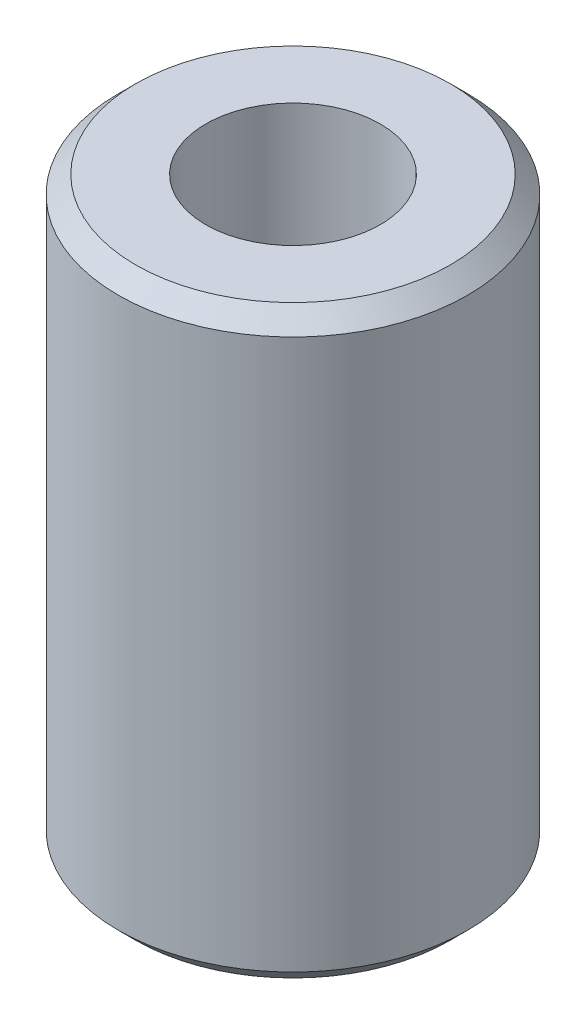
ISO-10303-21;
HEADER;
FILE_DESCRIPTION(('STEP AP214'),'2;1');
FILE_NAME('part.step','',(''),(''),'','','');
FILE_SCHEMA(('AUTOMOTIVE_DESIGN { 1 0 10303 214 1 1 1 1 }'));
ENDSEC;
DATA;
#1=APPLICATION_CONTEXT('core data for automotive mechanical design processes');
#2=APPLICATION_PROTOCOL_DEFINITION('international standard','automotive_design',2000,#1);
#3=PRODUCT_CONTEXT('',#1,'mechanical');
#4=PRODUCT('Part','Part','',(#3));
#5=PRODUCT_RELATED_PRODUCT_CATEGORY('part','',(#4));
#6=PRODUCT_DEFINITION_FORMATION('','',#4);
#7=PRODUCT_DEFINITION_CONTEXT('part definition',#1,'design');
#8=PRODUCT_DEFINITION('design','',#6,#7);
#9=PRODUCT_DEFINITION_SHAPE('','',#8);
#10=(LENGTH_UNIT() NAMED_UNIT(*) SI_UNIT(.MILLI.,.METRE.));
#11=(NAMED_UNIT(*) PLANE_ANGLE_UNIT() SI_UNIT($,.RADIAN.));
#12=(NAMED_UNIT(*) SI_UNIT($,.STERADIAN.) SOLID_ANGLE_UNIT());
#13=UNCERTAINTY_MEASURE_WITH_UNIT(LENGTH_MEASURE(1.E-05),#10,'distance_accuracy_value','');
#14=(GEOMETRIC_REPRESENTATION_CONTEXT(3) GLOBAL_UNCERTAINTY_ASSIGNED_CONTEXT((#13)) GLOBAL_UNIT_ASSIGNED_CONTEXT((#10,
#11,#12)) REPRESENTATION_CONTEXT('',''));
#15=CARTESIAN_POINT('',(0.,0.,0.));
#16=DIRECTION('',(0.,0.,1.));
#17=DIRECTION('',(1.,0.,0.));
#18=AXIS2_PLACEMENT_3D('',#15,#16,#17);
#19=CARTESIAN_POINT('',(0.,16.75,0.));
#20=DIRECTION('',(0.,1.,0.));
#21=DIRECTION('',(0.,0.,1.));
#22=AXIS2_PLACEMENT_3D('',#19,#20,#21);
#23=PLANE('',#22);
#24=CARTESIAN_POINT('',(0.,16.75,0.));
#25=DIRECTION('',(0.,1.,0.));
#26=DIRECTION('',(0.,0.,1.));
#27=AXIS2_PLACEMENT_3D('',#24,#25,#26);
#28=CIRCLE('',#27,4.49999999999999);
#29=CARTESIAN_POINT('',(0.,16.75,4.49999999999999));
#30=VERTEX_POINT('',#29);
#31=EDGE_CURVE('E10',#30,#30,#28,.T.);
#32=ORIENTED_EDGE('',*,*,#31,.T.);
#33=EDGE_LOOP('',(#32));
#34=FACE_BOUND('',#33,.T.);
#35=CARTESIAN_POINT('',(0.,16.75,0.));
#36=DIRECTION('',(0.,1.,0.));
#37=DIRECTION('',(0.,0.,1.));
#38=AXIS2_PLACEMENT_3D('',#35,#36,#37);
#39=CIRCLE('',#38,2.5);
#40=CARTESIAN_POINT('',(0.,16.75,2.5));
#41=VERTEX_POINT('',#40);
#42=EDGE_CURVE('E56',#41,#41,#39,.T.);
#43=ORIENTED_EDGE('',*,*,#42,.F.);
#44=EDGE_LOOP('',(#43));
#45=FACE_BOUND('',#44,.T.);
#46=ADVANCED_FACE('F30',(#34,#45),#23,.T.);
#47=CARTESIAN_POINT('',(0.,0.,0.));
#48=DIRECTION('',(0.,1.,0.));
#49=DIRECTION('',(0.,0.,1.));
#50=AXIS2_PLACEMENT_3D('',#47,#48,#49);
#51=PLANE('',#50);
#52=CARTESIAN_POINT('',(0.,0.,0.));
#53=DIRECTION('',(0.,1.,0.));
#54=DIRECTION('',(0.,0.,1.));
#55=AXIS2_PLACEMENT_3D('',#52,#53,#54);
#56=CIRCLE('',#55,3.00000000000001);
#57=CARTESIAN_POINT('',(0.,0.,3.00000000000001));
#58=VERTEX_POINT('',#57);
#59=EDGE_CURVE('E50',#58,#58,#56,.T.);
#60=ORIENTED_EDGE('',*,*,#59,.T.);
#61=EDGE_LOOP('',(#60));
#62=FACE_BOUND('',#61,.T.);
#63=CARTESIAN_POINT('',(0.,0.,0.));
#64=DIRECTION('',(0.,1.,0.));
#65=DIRECTION('',(0.,0.,1.));
#66=AXIS2_PLACEMENT_3D('',#63,#64,#65);
#67=CIRCLE('',#66,4.5);
#68=CARTESIAN_POINT('',(0.,0.,4.5));
#69=VERTEX_POINT('',#68);
#70=EDGE_CURVE('E53',#69,#69,#67,.F.);
#71=ORIENTED_EDGE('',*,*,#70,.T.);
#72=EDGE_LOOP('',(#71));
#73=FACE_BOUND('',#72,.T.);
#74=ADVANCED_FACE('F63',(#62,#73),#51,.F.);
#75=CARTESIAN_POINT('',(0.,16.75,0.));
#76=DIRECTION('',(0.,-1.,0.));
#77=DIRECTION('',(0.,0.,-1.));
#78=AXIS2_PLACEMENT_3D('',#75,#76,#77);
#79=CYLINDRICAL_SURFACE('',#78,5.);
#80=CARTESIAN_POINT('',(0.,0.5,0.));
#81=DIRECTION('',(0.,1.,0.));
#82=DIRECTION('',(0.,0.,1.));
#83=AXIS2_PLACEMENT_3D('',#80,#81,#82);
#84=CIRCLE('',#83,5.);
#85=CARTESIAN_POINT('',(0.,0.5,5.));
#86=VERTEX_POINT('',#85);
#87=EDGE_CURVE('E37',#86,#86,#84,.T.);
#88=ORIENTED_EDGE('',*,*,#87,.T.);
#89=EDGE_LOOP('',(#88));
#90=FACE_BOUND('',#89,.T.);
#91=CARTESIAN_POINT('',(0.,16.25,0.));
#92=DIRECTION('',(0.,1.,0.));
#93=DIRECTION('',(0.,0.,1.));
#94=AXIS2_PLACEMENT_3D('',#91,#92,#93);
#95=CIRCLE('',#94,5.);
#96=CARTESIAN_POINT('',(0.,16.25,5.));
#97=VERTEX_POINT('',#96);
#98=EDGE_CURVE('E41',#97,#97,#95,.F.);
#99=ORIENTED_EDGE('',*,*,#98,.T.);
#100=EDGE_LOOP('',(#99));
#101=FACE_BOUND('',#100,.T.);
#102=ADVANCED_FACE('F68',(#90,#101),#79,.T.);
#103=CARTESIAN_POINT('',(0.,16.75,0.));
#104=DIRECTION('',(0.,-1.,0.));
#105=DIRECTION('',(0.,0.,-1.));
#106=AXIS2_PLACEMENT_3D('',#103,#104,#105);
#107=CYLINDRICAL_SURFACE('',#106,2.5);
#108=CARTESIAN_POINT('',(0.,0.500000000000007,0.));
#109=DIRECTION('',(0.,1.,0.));
#110=DIRECTION('',(0.,0.,1.));
#111=AXIS2_PLACEMENT_3D('',#108,#109,#110);
#112=CIRCLE('',#111,2.5);
#113=CARTESIAN_POINT('',(0.,0.500000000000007,2.5));
#114=VERTEX_POINT('',#113);
#115=EDGE_CURVE('E45',#114,#114,#112,.F.);
#116=ORIENTED_EDGE('',*,*,#115,.T.);
#117=EDGE_LOOP('',(#116));
#118=FACE_BOUND('',#117,.T.);
#119=ORIENTED_EDGE('',*,*,#42,.T.);
#120=EDGE_LOOP('',(#119));
#121=FACE_BOUND('',#120,.T.);
#122=ADVANCED_FACE('F60',(#118,#121),#107,.F.);
#123=CARTESIAN_POINT('',(0.,0.,0.));
#124=DIRECTION('',(0.,-1.,0.));
#125=DIRECTION('',(0.,0.,-1.));
#126=AXIS2_PLACEMENT_3D('',#123,#124,#125);
#127=CONICAL_SURFACE('',#126,3.00000000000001,0.785398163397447);
#128=ORIENTED_EDGE('',*,*,#115,.F.);
#129=EDGE_LOOP('',(#128));
#130=FACE_BOUND('',#129,.T.);
#131=ORIENTED_EDGE('',*,*,#59,.F.);
#132=EDGE_LOOP('',(#131));
#133=FACE_BOUND('',#132,.T.);
#134=ADVANCED_FACE('F75',(#130,#133),#127,.F.);
#135=CARTESIAN_POINT('',(0.,0.5,0.));
#136=DIRECTION('',(0.,1.,0.));
#137=DIRECTION('',(0.,0.,1.));
#138=AXIS2_PLACEMENT_3D('',#135,#136,#137);
#139=CONICAL_SURFACE('',#138,5.,0.785398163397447);
#140=ORIENTED_EDGE('',*,*,#70,.F.);
#141=EDGE_LOOP('',(#140));
#142=FACE_BOUND('',#141,.T.);
#143=ORIENTED_EDGE('',*,*,#87,.F.);
#144=EDGE_LOOP('',(#143));
#145=FACE_BOUND('',#144,.T.);
#146=ADVANCED_FACE('F77',(#142,#145),#139,.T.);
#147=CARTESIAN_POINT('',(0.,16.75,0.));
#148=DIRECTION('',(0.,-1.,0.));
#149=DIRECTION('',(0.,0.,-1.));
#150=AXIS2_PLACEMENT_3D('',#147,#148,#149);
#151=CONICAL_SURFACE('',#150,4.49999999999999,0.785398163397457);
#152=ORIENTED_EDGE('',*,*,#98,.F.);
#153=EDGE_LOOP('',(#152));
#154=FACE_BOUND('',#153,.T.);
#155=ORIENTED_EDGE('',*,*,#31,.F.);
#156=EDGE_LOOP('',(#155));
#157=FACE_BOUND('',#156,.T.);
#158=ADVANCED_FACE('F32',(#154,#157),#151,.T.);
#159=CLOSED_SHELL('',(#46,#74,#102,#122,#134,#146,#158));
#160=MANIFOLD_SOLID_BREP('B2',#159);
#161=ADVANCED_BREP_SHAPE_REPRESENTATION('',(#18,#160),#14);
#162=SHAPE_DEFINITION_REPRESENTATION(#9,#161);
ENDSEC;
END-ISO-10303-21;
